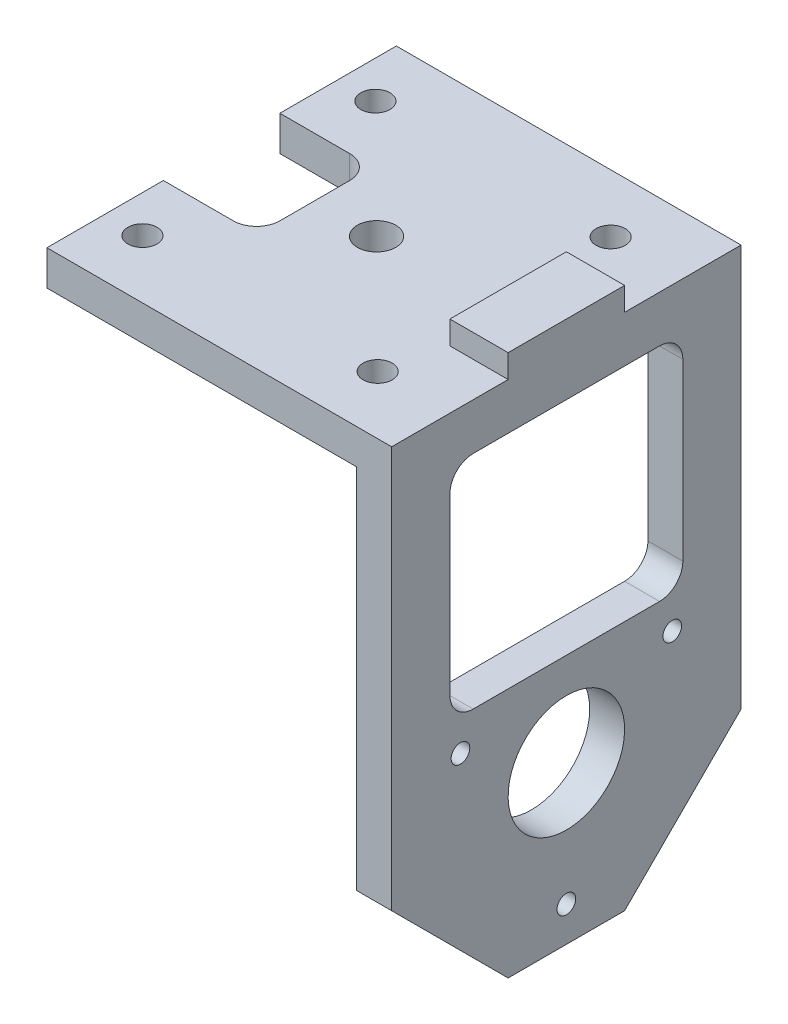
from build123d import *

# Parameters (mm, degrees)
EXTRUDE_1_DEPTH          = 30
CUT_EXTRUDE_1_REACH      = 62.209
SKETCH_2_R               = 5
SKETCH_2_W               = 20
SKETCH_2_H               = 19
HOLE_WIZARD_M2_1_D       = 1.6
PATTERN_CIRCULAR_1_COUNT = 3
FILLET_2_R               = 2
SKETCH_9_W               = 5
SKETCH_9_H               = 10
EXTRUDE_2_DEPTH          = 2
CUT_EXTRUDE_2_REACH      = 64.387
SKETCH_10_W              = 8
SKETCH_10_H              = 10
HOLE_WIZARD_M3_1_D       = 2.5
FILLET_3_R               = 2
SKETCH_15_W              = 35.309416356
SKETCH_15_H              = 2.937555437
CUT_EXTRUDE_3_DEPTH      = 10
CHAMFER_1_SIZE           = 10
HOLE_WIZARD_M4_1_D       = 3.3
HOLE_WIZARD_M4_1_DEPTH   = 11.5
HOLE_WIZARD_M4_1_TIP     = 0.991420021


with BuildPart() as part:
    # Sketch 1 → Extrude 1 (new body)
    with BuildSketch(Plane.XY):
        Polygon((0, 0), (26.6, 0), (26.6, -43), (29.6, -43), (29.6, 3), (0, 3), align=None)
    extrude(amount=-EXTRUDE_1_DEPTH)

    # Sketch 2 → Cut-Extrude 1 (cut, up to next)
    with BuildSketch(Plane(origin=(29.6, 0, 0), x_dir=(0, 0, -1), z_dir=(1, 0, 0)), mode=Mode.PRIVATE) as cut_extrude_1_sk1:
        with Locations(Location((15, -28, 0), (0, 0, 90))):
            Circle(SKETCH_2_R)
    cut_extrude_1_tool1 = extrude(cut_extrude_1_sk1.sketch, amount=-CUT_EXTRUDE_1_REACH, mode=Mode.PRIVATE) & part.part
    # Sketch 2 → Cut-Extrude 1 (cut, up to next)
    with BuildSketch(Plane(origin=(29.6, 0, 0), x_dir=(0, 0, -1), z_dir=(1, 0, 0)), mode=Mode.PRIVATE) as cut_extrude_1_sk2:
        with Locations((15, -10.5)):
            Rectangle(SKETCH_2_W, SKETCH_2_H)
    cut_extrude_1_tool2 = extrude(cut_extrude_1_sk2.sketch, amount=-CUT_EXTRUDE_1_REACH, mode=Mode.PRIVATE) & part.part
    add(cut_extrude_1_tool1.solids().sort_by_distance((29.6, -28, -15))[0], mode=Mode.SUBTRACT)
    add(cut_extrude_1_tool2.solids().sort_by_distance((29.6, -10.5, -15))[0], mode=Mode.SUBTRACT)

    # Hole Wizard M2 _1 (through all)
    with Locations(Plane(origin=(29.6, 0, 0), x_dir=(0, 0, -1), z_dir=(1, 0, 0))):
        with Locations((15, -38.5)):
            hole_wizard_m2_1 = Hole(HOLE_WIZARD_M2_1_D / 2)

    # Pattern Circular 1: Hole Wizard M2 _1 ×3 about axis
    pattern_circular_1_axis = Axis((0, -28, -15), (1, 0, 0))
    for i in range(1, PATTERN_CIRCULAR_1_COUNT):
        add(hole_wizard_m2_1.rotate(pattern_circular_1_axis, i * 360 / PATTERN_CIRCULAR_1_COUNT), mode=Mode.SUBTRACT)

    # Fillet 2
    fillet_2_edges = [part.edges().sort_by_distance(p)[0] for p in [
        (28.1, -1, -25),
        (28.1, -20, -25),
        (28.1, -20, -5),
        (28.1, -1, -5),
    ]]
    fillet(fillet_2_edges, radius=FILLET_2_R)

    # Sketch 9 → Extrude 2 (add)
    with BuildSketch(Plane(origin=(0, 3, 0), x_dir=(1, 0, 0), z_dir=(0, 1, 0))):
        with Locations((27.1, 15)):
            Rectangle(SKETCH_9_W, SKETCH_9_H)
    extrude(amount=EXTRUDE_2_DEPTH)

    # Sketch 10 → Cut-Extrude 2 (cut, up to next)
    with BuildSketch(Plane(origin=(0, 3, 0), x_dir=(1, 0, 0), z_dir=(0, 1, 0)), mode=Mode.PRIVATE) as cut_extrude_2_sk1:
        with Locations((4, 15)):
            Rectangle(SKETCH_10_W, SKETCH_10_H)
    cut_extrude_2_tool1 = extrude(cut_extrude_2_sk1.sketch, amount=-CUT_EXTRUDE_2_REACH, mode=Mode.PRIVATE) & part.part
    add(cut_extrude_2_tool1.solids().sort_by_distance((4, 3, -15))[0], mode=Mode.SUBTRACT)

    # Hole Wizard M3 _1 (through all)
    with Locations(Plane(origin=(0, 3, 0), x_dir=(1, 0, 0), z_dir=(0, 1, 0))):
        with Locations((23.4, 25), (3.2, 25)):
            hole_wizard_m3_1 = Hole(HOLE_WIZARD_M3_1_D / 2)

    # Mirror 1: Hole Wizard M3 _1 across plane
    add(hole_wizard_m3_1.mirror(Plane.XY.offset(-15)), mode=Mode.SUBTRACT)

    # Fillet 3
    fillet_3_edges = [part.edges().sort_by_distance(p)[0] for p in [
        (8, 1.5, -20),
        (8, 1.5, -10),
    ]]
    fillet(fillet_3_edges, radius=FILLET_3_R)

    # Sketch 15 → Cut-Extrude 3 (cut)
    with BuildSketch(Plane(origin=(29.6, 0, 0), x_dir=(0, 0, -1), z_dir=(1, 0, 0))):
        with Locations((15.284968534, -42.968777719)):
            Rectangle(SKETCH_15_W, SKETCH_15_H)
    extrude(amount=-CUT_EXTRUDE_3_DEPTH, mode=Mode.SUBTRACT)

    # Chamfer 1
    chamfer_1_edges = [part.edges().sort_by_distance(p)[0] for p in [
        (28.1, -41.5, 0),
        (28.1, -41.5, -30),
    ]]
    chamfer(chamfer_1_edges, length=CHAMFER_1_SIZE)

    # Hole Wizard M4 _1
    with Locations(Plane(origin=(13.3, 3, -15), x_dir=(0, 0, 1), z_dir=(0, 1, 0))):
        with Locations((0, 0)):
            Hole(HOLE_WIZARD_M4_1_D / 2, depth=HOLE_WIZARD_M4_1_DEPTH)
            with Locations((0, 0, -(HOLE_WIZARD_M4_1_DEPTH + HOLE_WIZARD_M4_1_TIP / 2))):  # 118° drill point
                Cone(0, HOLE_WIZARD_M4_1_D / 2, HOLE_WIZARD_M4_1_TIP, mode=Mode.SUBTRACT)


solid = part.part
